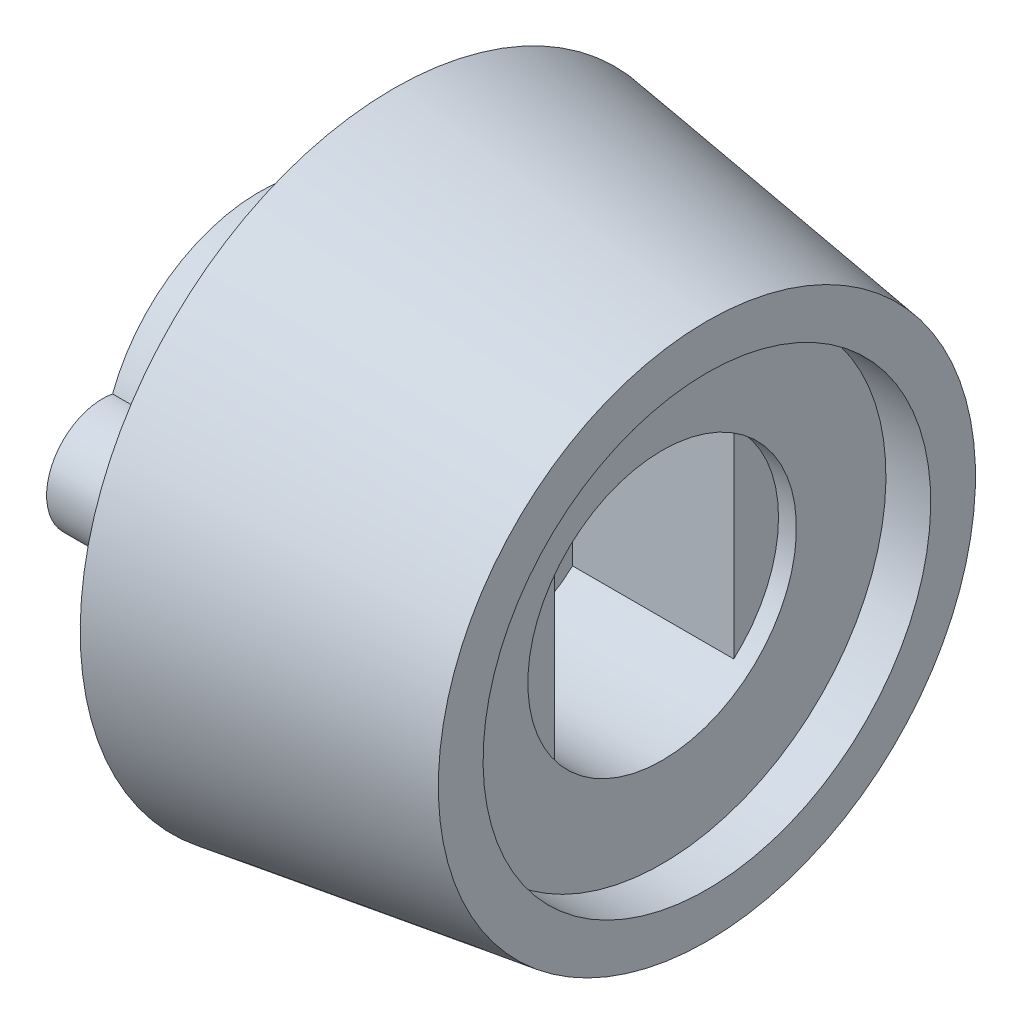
ISO-10303-21;
HEADER;
FILE_DESCRIPTION(('STEP AP214'),'2;1');
FILE_NAME('part.step','',(''),(''),'','','');
FILE_SCHEMA(('AUTOMOTIVE_DESIGN { 1 0 10303 214 1 1 1 1 }'));
ENDSEC;
DATA;
#1=APPLICATION_CONTEXT('core data for automotive mechanical design processes');
#2=APPLICATION_PROTOCOL_DEFINITION('international standard','automotive_design',2000,#1);
#3=PRODUCT_CONTEXT('',#1,'mechanical');
#4=PRODUCT('Part','Part','',(#3));
#5=PRODUCT_RELATED_PRODUCT_CATEGORY('part','',(#4));
#6=PRODUCT_DEFINITION_FORMATION('','',#4);
#7=PRODUCT_DEFINITION_CONTEXT('part definition',#1,'design');
#8=PRODUCT_DEFINITION('design','',#6,#7);
#9=PRODUCT_DEFINITION_SHAPE('','',#8);
#10=(LENGTH_UNIT() NAMED_UNIT(*) SI_UNIT(.MILLI.,.METRE.));
#11=(NAMED_UNIT(*) PLANE_ANGLE_UNIT() SI_UNIT($,.RADIAN.));
#12=(NAMED_UNIT(*) SI_UNIT($,.STERADIAN.) SOLID_ANGLE_UNIT());
#13=UNCERTAINTY_MEASURE_WITH_UNIT(LENGTH_MEASURE(1.E-05),#10,'distance_accuracy_value','');
#14=(GEOMETRIC_REPRESENTATION_CONTEXT(3) GLOBAL_UNCERTAINTY_ASSIGNED_CONTEXT((#13)) GLOBAL_UNIT_ASSIGNED_CONTEXT((#10,
#11,#12)) REPRESENTATION_CONTEXT('',''));
#15=CARTESIAN_POINT('',(0.,0.,0.));
#16=DIRECTION('',(0.,0.,1.));
#17=DIRECTION('',(1.,0.,0.));
#18=AXIS2_PLACEMENT_3D('',#15,#16,#17);
#19=CARTESIAN_POINT('',(-16.0928355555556,0.,0.));
#20=DIRECTION('',(1.,0.,0.));
#21=DIRECTION('',(0.,1.,0.));
#22=AXIS2_PLACEMENT_3D('',#19,#20,#21);
#23=PLANE('',#22);
#24=CARTESIAN_POINT('',(-16.0928355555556,0.,0.));
#25=DIRECTION('',(1.,0.,0.));
#26=DIRECTION('',(0.,1.,0.));
#27=AXIS2_PLACEMENT_3D('',#24,#25,#26);
#28=CIRCLE('',#27,3.);
#29=CARTESIAN_POINT('',(-16.0928355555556,-2.23606797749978,2.));
#30=VERTEX_POINT('',#29);
#31=CARTESIAN_POINT('',(-16.0928355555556,-2.23606797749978,-2.));
#32=VERTEX_POINT('',#31);
#33=EDGE_CURVE('E108',#30,#32,#28,.T.);
#34=ORIENTED_EDGE('',*,*,#33,.T.);
#35=DIRECTION('',(0.,-1.,0.));
#36=VECTOR('',#35,1.);
#37=CARTESIAN_POINT('',(-16.0928355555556,2.2360679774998,-2.));
#38=LINE('',#37,#36);
#39=CARTESIAN_POINT('',(-16.0928355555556,0.,-2.));
#40=VERTEX_POINT('',#39);
#41=EDGE_CURVE('E104',#40,#32,#38,.T.);
#42=ORIENTED_EDGE('',*,*,#41,.F.);
#43=CARTESIAN_POINT('',(-16.0928355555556,0.,0.));
#44=DIRECTION('',(1.,0.,0.));
#45=DIRECTION('',(0.,1.,0.));
#46=AXIS2_PLACEMENT_3D('',#43,#44,#45);
#47=CIRCLE('',#46,2.);
#48=CARTESIAN_POINT('',(-16.0928355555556,0.,2.));
#49=VERTEX_POINT('',#48);
#50=EDGE_CURVE('E112',#40,#49,#47,.F.);
#51=ORIENTED_EDGE('',*,*,#50,.T.);
#52=DIRECTION('',(0.,1.,0.));
#53=VECTOR('',#52,1.);
#54=CARTESIAN_POINT('',(-16.0928355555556,-2.23606797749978,2.));
#55=LINE('',#54,#53);
#56=EDGE_CURVE('E273',#30,#49,#55,.T.);
#57=ORIENTED_EDGE('',*,*,#56,.F.);
#58=EDGE_LOOP('',(#34,#42,#51,#57));
#59=FACE_BOUND('',#58,.T.);
#60=ADVANCED_FACE('F26',(#59),#23,.T.);
#61=EDGE_CURVE('E30',#49,#40,#47,.F.);
#62=ORIENTED_EDGE('',*,*,#61,.T.);
#63=CARTESIAN_POINT('',(-16.0928355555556,2.2360679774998,-2.));
#64=VERTEX_POINT('',#63);
#65=EDGE_CURVE('E88',#64,#40,#38,.T.);
#66=ORIENTED_EDGE('',*,*,#65,.F.);
#67=CARTESIAN_POINT('',(-16.0928355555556,2.2360679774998,2.));
#68=VERTEX_POINT('',#67);
#69=EDGE_CURVE('E101',#64,#68,#28,.T.);
#70=ORIENTED_EDGE('',*,*,#69,.T.);
#71=EDGE_CURVE('E95',#49,#68,#55,.T.);
#72=ORIENTED_EDGE('',*,*,#71,.F.);
#73=EDGE_LOOP('',(#62,#66,#70,#72));
#74=FACE_BOUND('',#73,.T.);
#75=ADVANCED_FACE('F99',(#74),#23,.T.);
#76=CARTESIAN_POINT('',(-16.0928355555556,0.,0.));
#77=DIRECTION('',(1.,0.,0.));
#78=DIRECTION('',(0.,1.,0.));
#79=AXIS2_PLACEMENT_3D('',#76,#77,#78);
#80=CYLINDRICAL_SURFACE('',#79,3.);
#81=CARTESIAN_POINT('',(-12.0928355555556,0.,0.));
#82=DIRECTION('',(1.,0.,0.));
#83=DIRECTION('',(0.,1.,0.));
#84=AXIS2_PLACEMENT_3D('',#81,#82,#83);
#85=CIRCLE('',#84,3.);
#86=CARTESIAN_POINT('',(-12.0928355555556,3.00000000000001,0.));
#87=VERTEX_POINT('',#86);
#88=EDGE_CURVE('E109',#87,#87,#85,.T.);
#89=ORIENTED_EDGE('',*,*,#88,.T.);
#90=EDGE_LOOP('',(#89));
#91=FACE_BOUND('',#90,.T.);
#92=DIRECTION('',(-1.,0.,0.));
#93=VECTOR('',#92,1.);
#94=CARTESIAN_POINT('',(-12.4928355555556,2.2360679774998,-2.));
#95=LINE('',#94,#93);
#96=CARTESIAN_POINT('',(-12.4928355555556,2.2360679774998,-2.));
#97=VERTEX_POINT('',#96);
#98=EDGE_CURVE('E85',#97,#64,#95,.T.);
#99=ORIENTED_EDGE('',*,*,#98,.F.);
#100=CARTESIAN_POINT('',(-12.4928355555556,0.,0.));
#101=DIRECTION('',(1.,0.,0.));
#102=DIRECTION('',(0.,1.,0.));
#103=AXIS2_PLACEMENT_3D('',#100,#101,#102);
#104=CIRCLE('',#103,3.);
#105=CARTESIAN_POINT('',(-12.4928355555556,-2.23606797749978,-2.));
#106=VERTEX_POINT('',#105);
#107=EDGE_CURVE('E103',#106,#97,#104,.T.);
#108=ORIENTED_EDGE('',*,*,#107,.F.);
#109=DIRECTION('',(-1.,0.,0.));
#110=VECTOR('',#109,1.);
#111=CARTESIAN_POINT('',(-12.4928355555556,-2.23606797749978,-2.));
#112=LINE('',#111,#110);
#113=EDGE_CURVE('E42',#106,#32,#112,.T.);
#114=ORIENTED_EDGE('',*,*,#113,.T.);
#115=ORIENTED_EDGE('',*,*,#33,.F.);
#116=DIRECTION('',(-1.,0.,0.));
#117=VECTOR('',#116,1.);
#118=CARTESIAN_POINT('',(-12.4928355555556,-2.23606797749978,2.));
#119=LINE('',#118,#117);
#120=CARTESIAN_POINT('',(-12.4928355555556,-2.23606797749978,2.));
#121=VERTEX_POINT('',#120);
#122=EDGE_CURVE('E114',#121,#30,#119,.T.);
#123=ORIENTED_EDGE('',*,*,#122,.F.);
#124=CARTESIAN_POINT('',(-12.4928355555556,0.,0.));
#125=DIRECTION('',(1.,0.,0.));
#126=DIRECTION('',(0.,1.,0.));
#127=AXIS2_PLACEMENT_3D('',#124,#125,#126);
#128=CIRCLE('',#127,3.);
#129=CARTESIAN_POINT('',(-12.4928355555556,2.2360679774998,2.));
#130=VERTEX_POINT('',#129);
#131=EDGE_CURVE('E276',#130,#121,#128,.T.);
#132=ORIENTED_EDGE('',*,*,#131,.F.);
#133=DIRECTION('',(-1.,0.,0.));
#134=VECTOR('',#133,1.);
#135=CARTESIAN_POINT('',(-12.4928355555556,2.2360679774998,2.));
#136=LINE('',#135,#134);
#137=EDGE_CURVE('E50',#130,#68,#136,.T.);
#138=ORIENTED_EDGE('',*,*,#137,.T.);
#139=ORIENTED_EDGE('',*,*,#69,.F.);
#140=EDGE_LOOP('',(#99,#108,#114,#115,#123,#132,#138,#139));
#141=FACE_BOUND('',#140,.T.);
#142=ADVANCED_FACE('F106',(#91,#141),#80,.F.);
#143=CARTESIAN_POINT('',(-11.0928355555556,0.,0.));
#144=DIRECTION('',(-1.,0.,0.));
#145=DIRECTION('',(0.,-1.,0.));
#146=AXIS2_PLACEMENT_3D('',#143,#144,#145);
#147=CYLINDRICAL_SURFACE('',#146,2.);
#148=CARTESIAN_POINT('',(-21.0928355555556,0.,0.));
#149=DIRECTION('',(-1.,0.,0.));
#150=DIRECTION('',(0.,-1.,0.));
#151=AXIS2_PLACEMENT_3D('',#148,#149,#150);
#152=CIRCLE('',#151,2.);
#153=CARTESIAN_POINT('',(-21.0928355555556,-1.99999999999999,0.));
#154=VERTEX_POINT('',#153);
#155=EDGE_CURVE('E118',#154,#154,#152,.T.);
#156=ORIENTED_EDGE('',*,*,#155,.T.);
#157=EDGE_LOOP('',(#156));
#158=FACE_BOUND('',#157,.T.);
#159=ORIENTED_EDGE('',*,*,#61,.F.);
#160=ORIENTED_EDGE('',*,*,#50,.F.);
#161=EDGE_LOOP('',(#159,#160));
#162=FACE_BOUND('',#161,.T.);
#163=ADVANCED_FACE('F174',(#158,#162),#147,.F.);
#164=CARTESIAN_POINT('',(-18.0928355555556,0.,0.));
#165=DIRECTION('',(-1.,0.,0.));
#166=DIRECTION('',(0.,-1.,0.));
#167=AXIS2_PLACEMENT_3D('',#164,#165,#166);
#168=PLANE('',#167);
#169=CARTESIAN_POINT('',(-18.0928355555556,0.,0.));
#170=DIRECTION('',(1.,0.,0.));
#171=DIRECTION('',(0.,1.,0.));
#172=AXIS2_PLACEMENT_3D('',#169,#170,#171);
#173=CIRCLE('',#172,7.);
#174=CARTESIAN_POINT('',(-18.0928355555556,7.,0.));
#175=VERTEX_POINT('',#174);
#176=EDGE_CURVE('E11',#175,#175,#173,.T.);
#177=ORIENTED_EDGE('',*,*,#176,.F.);
#178=EDGE_LOOP('',(#177));
#179=FACE_BOUND('',#178,.T.);
#180=CARTESIAN_POINT('',(-18.0928355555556,0.,0.));
#181=DIRECTION('',(-1.,0.,0.));
#182=DIRECTION('',(0.,-1.,0.));
#183=AXIS2_PLACEMENT_3D('',#180,#181,#182);
#184=CIRCLE('',#183,3.5);
#185=CARTESIAN_POINT('',(-18.0928355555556,1.23017846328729,3.27668444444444));
#186=VERTEX_POINT('',#185);
#187=CARTESIAN_POINT('',(-18.0928355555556,-1.23017846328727,3.27668444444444));
#188=VERTEX_POINT('',#187);
#189=EDGE_CURVE('E136',#186,#188,#184,.T.);
#190=ORIENTED_EDGE('',*,*,#189,.F.);
#191=CARTESIAN_POINT('',(-18.0928355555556,0.,3.5));
#192=DIRECTION('',(-1.,0.,0.));
#193=DIRECTION('',(0.,-1.,0.));
#194=AXIS2_PLACEMENT_3D('',#191,#192,#193);
#195=CIRCLE('',#194,1.25028352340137);
#196=EDGE_CURVE('E127',#188,#186,#195,.T.);
#197=ORIENTED_EDGE('',*,*,#196,.F.);
#198=EDGE_LOOP('',(#190,#197));
#199=FACE_BOUND('',#198,.T.);
#200=ADVANCED_FACE('F28',(#179,#199),#168,.T.);
#201=CARTESIAN_POINT('',(-21.0928355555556,0.,0.));
#202=DIRECTION('',(1.,0.,0.));
#203=DIRECTION('',(0.,1.,0.));
#204=AXIS2_PLACEMENT_3D('',#201,#202,#203);
#205=CYLINDRICAL_SURFACE('',#204,3.5);
#206=DIRECTION('',(1.,0.,0.));
#207=VECTOR('',#206,1.);
#208=CARTESIAN_POINT('',(-19.5928355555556,-1.23017846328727,3.27668444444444));
#209=LINE('',#208,#207);
#210=CARTESIAN_POINT('',(-21.0928355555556,-1.23017846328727,3.27668444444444));
#211=VERTEX_POINT('',#210);
#212=EDGE_CURVE('E134',#211,#188,#209,.T.);
#213=ORIENTED_EDGE('',*,*,#212,.F.);
#214=CARTESIAN_POINT('',(-21.0928355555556,0.,0.));
#215=DIRECTION('',(-1.,0.,0.));
#216=DIRECTION('',(0.,-1.,0.));
#217=AXIS2_PLACEMENT_3D('',#214,#215,#216);
#218=CIRCLE('',#217,3.5);
#219=CARTESIAN_POINT('',(-21.0928355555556,1.23017846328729,3.27668444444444));
#220=VERTEX_POINT('',#219);
#221=EDGE_CURVE('E139',#220,#211,#218,.T.);
#222=ORIENTED_EDGE('',*,*,#221,.F.);
#223=DIRECTION('',(1.,0.,0.));
#224=VECTOR('',#223,1.);
#225=CARTESIAN_POINT('',(-19.5928355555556,1.23017846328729,3.27668444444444));
#226=LINE('',#225,#224);
#227=EDGE_CURVE('E131',#186,#220,#226,.F.);
#228=ORIENTED_EDGE('',*,*,#227,.F.);
#229=ORIENTED_EDGE('',*,*,#189,.T.);
#230=EDGE_LOOP('',(#213,#222,#228,#229));
#231=FACE_BOUND('',#230,.T.);
#232=ADVANCED_FACE('F149',(#231),#205,.T.);
#233=CARTESIAN_POINT('',(-11.0928355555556,0.,0.));
#234=DIRECTION('',(-1.,0.,0.));
#235=DIRECTION('',(0.,-1.,0.));
#236=AXIS2_PLACEMENT_3D('',#233,#234,#235);
#237=CONICAL_SURFACE('',#236,6.,0.141897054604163);
#238=ORIENTED_EDGE('',*,*,#176,.T.);
#239=EDGE_LOOP('',(#238));
#240=FACE_BOUND('',#239,.T.);
#241=CARTESIAN_POINT('',(-11.0928355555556,0.,0.));
#242=DIRECTION('',(1.,0.,0.));
#243=DIRECTION('',(0.,1.,0.));
#244=AXIS2_PLACEMENT_3D('',#241,#242,#243);
#245=CIRCLE('',#244,6.);
#246=CARTESIAN_POINT('',(-11.0928355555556,5.99999999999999,0.));
#247=VERTEX_POINT('',#246);
#248=EDGE_CURVE('E35',#247,#247,#245,.T.);
#249=ORIENTED_EDGE('',*,*,#248,.F.);
#250=EDGE_LOOP('',(#249));
#251=FACE_BOUND('',#250,.T.);
#252=ADVANCED_FACE('F147',(#240,#251),#237,.T.);
#253=CARTESIAN_POINT('',(-11.0928355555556,5.99999999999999,0.));
#254=DIRECTION('',(1.,0.,0.));
#255=DIRECTION('',(0.,1.,0.));
#256=AXIS2_PLACEMENT_3D('',#253,#254,#255);
#257=PLANE('',#256);
#258=CARTESIAN_POINT('',(-11.0928355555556,0.,0.));
#259=DIRECTION('',(1.,0.,0.));
#260=DIRECTION('',(0.,1.,0.));
#261=AXIS2_PLACEMENT_3D('',#258,#259,#260);
#262=CIRCLE('',#261,5.);
#263=CARTESIAN_POINT('',(-11.0928355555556,5.00000000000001,0.));
#264=VERTEX_POINT('',#263);
#265=EDGE_CURVE('E121',#264,#264,#262,.T.);
#266=ORIENTED_EDGE('',*,*,#265,.F.);
#267=EDGE_LOOP('',(#266));
#268=FACE_BOUND('',#267,.T.);
#269=ORIENTED_EDGE('',*,*,#248,.T.);
#270=EDGE_LOOP('',(#269));
#271=FACE_BOUND('',#270,.T.);
#272=ADVANCED_FACE('F145',(#268,#271),#257,.T.);
#273=CARTESIAN_POINT('',(-21.0928355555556,0.,0.));
#274=DIRECTION('',(-1.,0.,0.));
#275=DIRECTION('',(0.,-1.,0.));
#276=AXIS2_PLACEMENT_3D('',#273,#274,#275);
#277=PLANE('',#276);
#278=ORIENTED_EDGE('',*,*,#155,.F.);
#279=EDGE_LOOP('',(#278));
#280=FACE_BOUND('',#279,.T.);
#281=ORIENTED_EDGE('',*,*,#221,.T.);
#282=CARTESIAN_POINT('',(-21.0928355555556,0.,3.5));
#283=DIRECTION('',(-1.,0.,0.));
#284=DIRECTION('',(0.,-1.,0.));
#285=AXIS2_PLACEMENT_3D('',#282,#283,#284);
#286=CIRCLE('',#285,1.25028352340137);
#287=EDGE_CURVE('E129',#211,#220,#286,.T.);
#288=ORIENTED_EDGE('',*,*,#287,.T.);
#289=EDGE_LOOP('',(#281,#288));
#290=FACE_BOUND('',#289,.T.);
#291=ADVANCED_FACE('F155',(#280,#290),#277,.T.);
#292=CARTESIAN_POINT('',(-24.6291713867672,0.,3.5));
#293=DIRECTION('',(1.,0.,0.));
#294=DIRECTION('',(0.,1.,0.));
#295=AXIS2_PLACEMENT_3D('',#292,#293,#294);
#296=CYLINDRICAL_SURFACE('',#295,1.25028352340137);
#297=ORIENTED_EDGE('',*,*,#287,.F.);
#298=ORIENTED_EDGE('',*,*,#212,.T.);
#299=ORIENTED_EDGE('',*,*,#196,.T.);
#300=ORIENTED_EDGE('',*,*,#227,.T.);
#301=EDGE_LOOP('',(#297,#298,#299,#300));
#302=FACE_BOUND('',#301,.T.);
#303=ADVANCED_FACE('F185',(#302),#296,.T.);
#304=CARTESIAN_POINT('',(-12.0928355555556,0.,0.));
#305=DIRECTION('',(1.,0.,0.));
#306=DIRECTION('',(0.,1.,0.));
#307=AXIS2_PLACEMENT_3D('',#304,#305,#306);
#308=CYLINDRICAL_SURFACE('',#307,5.);
#309=CARTESIAN_POINT('',(-12.0928355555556,0.,0.));
#310=DIRECTION('',(1.,0.,0.));
#311=DIRECTION('',(0.,1.,0.));
#312=AXIS2_PLACEMENT_3D('',#309,#310,#311);
#313=CIRCLE('',#312,5.);
#314=CARTESIAN_POINT('',(-12.0928355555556,5.00000000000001,0.));
#315=VERTEX_POINT('',#314);
#316=EDGE_CURVE('E124',#315,#315,#313,.T.);
#317=ORIENTED_EDGE('',*,*,#316,.F.);
#318=EDGE_LOOP('',(#317));
#319=FACE_BOUND('',#318,.T.);
#320=ORIENTED_EDGE('',*,*,#265,.T.);
#321=EDGE_LOOP('',(#320));
#322=FACE_BOUND('',#321,.T.);
#323=ADVANCED_FACE('F181',(#319,#322),#308,.F.);
#324=CARTESIAN_POINT('',(-12.0928355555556,0.,0.));
#325=DIRECTION('',(1.,0.,0.));
#326=DIRECTION('',(0.,1.,0.));
#327=AXIS2_PLACEMENT_3D('',#324,#325,#326);
#328=PLANE('',#327);
#329=ORIENTED_EDGE('',*,*,#88,.F.);
#330=EDGE_LOOP('',(#329));
#331=FACE_BOUND('',#330,.T.);
#332=ORIENTED_EDGE('',*,*,#316,.T.);
#333=EDGE_LOOP('',(#332));
#334=FACE_BOUND('',#333,.T.);
#335=ADVANCED_FACE('F179',(#331,#334),#328,.T.);
#336=CARTESIAN_POINT('',(-12.4928355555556,-2.23606797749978,2.));
#337=DIRECTION('',(0.,0.,1.));
#338=DIRECTION('',(1.,0.,0.));
#339=AXIS2_PLACEMENT_3D('',#336,#337,#338);
#340=PLANE('',#339);
#341=ORIENTED_EDGE('',*,*,#56,.T.);
#342=ORIENTED_EDGE('',*,*,#71,.T.);
#343=ORIENTED_EDGE('',*,*,#137,.F.);
#344=DIRECTION('',(0.,1.,0.));
#345=VECTOR('',#344,1.);
#346=CARTESIAN_POINT('',(-12.4928355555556,-2.23606797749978,2.));
#347=LINE('',#346,#345);
#348=EDGE_CURVE('E279',#121,#130,#347,.T.);
#349=ORIENTED_EDGE('',*,*,#348,.F.);
#350=ORIENTED_EDGE('',*,*,#122,.T.);
#351=EDGE_LOOP('',(#341,#342,#343,#349,#350));
#352=FACE_BOUND('',#351,.T.);
#353=ADVANCED_FACE('F170',(#352),#340,.F.);
#354=CARTESIAN_POINT('',(-12.4928355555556,0.,0.));
#355=DIRECTION('',(1.,0.,0.));
#356=DIRECTION('',(0.,1.,0.));
#357=AXIS2_PLACEMENT_3D('',#354,#355,#356);
#358=PLANE('',#357);
#359=ORIENTED_EDGE('',*,*,#131,.T.);
#360=ORIENTED_EDGE('',*,*,#348,.T.);
#361=EDGE_LOOP('',(#359,#360));
#362=FACE_BOUND('',#361,.T.);
#363=ADVANCED_FACE('F248',(#362),#358,.T.);
#364=CARTESIAN_POINT('',(-12.4928355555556,2.2360679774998,-2.));
#365=DIRECTION('',(0.,0.,-1.));
#366=DIRECTION('',(-1.,0.,0.));
#367=AXIS2_PLACEMENT_3D('',#364,#365,#366);
#368=PLANE('',#367);
#369=ORIENTED_EDGE('',*,*,#65,.T.);
#370=ORIENTED_EDGE('',*,*,#41,.T.);
#371=ORIENTED_EDGE('',*,*,#113,.F.);
#372=DIRECTION('',(0.,-1.,0.));
#373=VECTOR('',#372,1.);
#374=CARTESIAN_POINT('',(-12.4928355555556,2.2360679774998,-2.));
#375=LINE('',#374,#373);
#376=EDGE_CURVE('E90',#97,#106,#375,.T.);
#377=ORIENTED_EDGE('',*,*,#376,.F.);
#378=ORIENTED_EDGE('',*,*,#98,.T.);
#379=EDGE_LOOP('',(#369,#370,#371,#377,#378));
#380=FACE_BOUND('',#379,.T.);
#381=ADVANCED_FACE('F87',(#380),#368,.F.);
#382=CARTESIAN_POINT('',(-12.4928355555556,0.,0.));
#383=DIRECTION('',(1.,0.,0.));
#384=DIRECTION('',(0.,1.,0.));
#385=AXIS2_PLACEMENT_3D('',#382,#383,#384);
#386=PLANE('',#385);
#387=ORIENTED_EDGE('',*,*,#107,.T.);
#388=ORIENTED_EDGE('',*,*,#376,.T.);
#389=EDGE_LOOP('',(#387,#388));
#390=FACE_BOUND('',#389,.T.);
#391=ADVANCED_FACE('F260',(#390),#386,.T.);
#392=CLOSED_SHELL('',(#60,#75,#142,#163,#200,#232,#252,#272,#291,#303,#323,#335,#353,#363,#381,#391));
#393=MANIFOLD_SOLID_BREP('B2',#392);
#394=ADVANCED_BREP_SHAPE_REPRESENTATION('',(#18,#393),#14);
#395=SHAPE_DEFINITION_REPRESENTATION(#9,#394);
ENDSEC;
END-ISO-10303-21;
